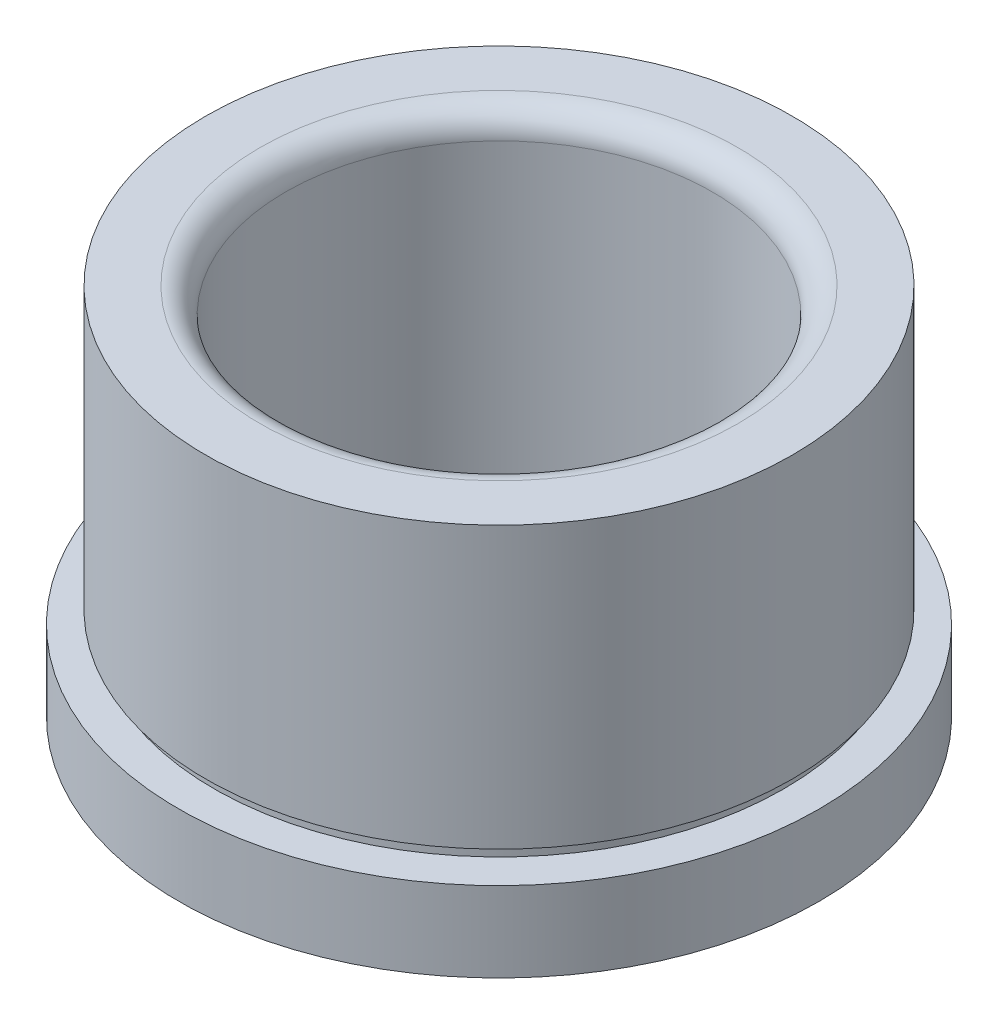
ISO-10303-21;
HEADER;
FILE_DESCRIPTION(('STEP AP214'),'2;1');
FILE_NAME('part.step','',(''),(''),'','','');
FILE_SCHEMA(('AUTOMOTIVE_DESIGN { 1 0 10303 214 1 1 1 1 }'));
ENDSEC;
DATA;
#1=APPLICATION_CONTEXT('core data for automotive mechanical design processes');
#2=APPLICATION_PROTOCOL_DEFINITION('international standard','automotive_design',2000,#1);
#3=PRODUCT_CONTEXT('',#1,'mechanical');
#4=PRODUCT('Part','Part','',(#3));
#5=PRODUCT_RELATED_PRODUCT_CATEGORY('part','',(#4));
#6=PRODUCT_DEFINITION_FORMATION('','',#4);
#7=PRODUCT_DEFINITION_CONTEXT('part definition',#1,'design');
#8=PRODUCT_DEFINITION('design','',#6,#7);
#9=PRODUCT_DEFINITION_SHAPE('','',#8);
#10=(LENGTH_UNIT() NAMED_UNIT(*) SI_UNIT(.MILLI.,.METRE.));
#11=(NAMED_UNIT(*) PLANE_ANGLE_UNIT() SI_UNIT($,.RADIAN.));
#12=(NAMED_UNIT(*) SI_UNIT($,.STERADIAN.) SOLID_ANGLE_UNIT());
#13=UNCERTAINTY_MEASURE_WITH_UNIT(LENGTH_MEASURE(1.E-05),#10,'distance_accuracy_value','');
#14=(GEOMETRIC_REPRESENTATION_CONTEXT(3) GLOBAL_UNCERTAINTY_ASSIGNED_CONTEXT((#13)) GLOBAL_UNIT_ASSIGNED_CONTEXT((#10,
#11,#12)) REPRESENTATION_CONTEXT('',''));
#15=CARTESIAN_POINT('',(0.,0.,0.));
#16=DIRECTION('',(0.,0.,1.));
#17=DIRECTION('',(1.,0.,0.));
#18=AXIS2_PLACEMENT_3D('',#15,#16,#17);
#19=CARTESIAN_POINT('',(-17.46885,38.1506908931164,0.));
#20=DIRECTION('',(0.,-1.,0.));
#21=DIRECTION('',(1.,0.,0.));
#22=AXIS2_PLACEMENT_3D('',#19,#20,#21);
#23=PLANE('',#22);
#24=CARTESIAN_POINT('',(-1.33202502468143E-13,38.1506908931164,0.));
#25=DIRECTION('',(0.,-1.,0.));
#26=DIRECTION('',(1.,0.,0.));
#27=AXIS2_PLACEMENT_3D('',#24,#25,#26);
#28=CIRCLE('',#27,14.2303499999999);
#29=CARTESIAN_POINT('',(14.2303499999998,38.1506908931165,0.));
#30=VERTEX_POINT('',#29);
#31=EDGE_CURVE('E36',#30,#30,#28,.T.);
#32=ORIENTED_EDGE('',*,*,#31,.T.);
#33=EDGE_LOOP('',(#32));
#34=FACE_BOUND('',#33,.T.);
#35=CARTESIAN_POINT('',(-1.33202502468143E-13,38.1506908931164,0.));
#36=DIRECTION('',(0.,-1.,0.));
#37=DIRECTION('',(1.,0.,0.));
#38=AXIS2_PLACEMENT_3D('',#35,#36,#37);
#39=CIRCLE('',#38,17.4688499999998);
#40=CARTESIAN_POINT('',(17.4688499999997,38.1506908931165,0.));
#41=VERTEX_POINT('',#40);
#42=EDGE_CURVE('E40',#41,#41,#39,.T.);
#43=ORIENTED_EDGE('',*,*,#42,.F.);
#44=EDGE_LOOP('',(#43));
#45=FACE_BOUND('',#44,.T.);
#46=ADVANCED_FACE('F29',(#34,#45),#23,.F.);
#47=CARTESIAN_POINT('',(3.49148336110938E-12,-1000.,0.));
#48=DIRECTION('',(0.,-1.,0.));
#49=DIRECTION('',(1.,0.,0.));
#50=AXIS2_PLACEMENT_3D('',#47,#48,#49);
#51=CYLINDRICAL_SURFACE('',#50,17.4688499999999);
#52=CARTESIAN_POINT('',(0.,21.4501908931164,0.));
#53=DIRECTION('',(0.,-1.,0.));
#54=DIRECTION('',(1.,0.,0.));
#55=AXIS2_PLACEMENT_3D('',#52,#53,#54);
#56=CIRCLE('',#55,17.4688499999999);
#57=CARTESIAN_POINT('',(17.4688499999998,21.4501908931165,0.));
#58=VERTEX_POINT('',#57);
#59=EDGE_CURVE('E44',#58,#58,#56,.T.);
#60=ORIENTED_EDGE('',*,*,#59,.F.);
#61=EDGE_LOOP('',(#60));
#62=FACE_BOUND('',#61,.T.);
#63=ORIENTED_EDGE('',*,*,#42,.T.);
#64=EDGE_LOOP('',(#63));
#65=FACE_BOUND('',#64,.T.);
#66=ADVANCED_FACE('F103',(#62,#65),#51,.T.);
#67=CARTESIAN_POINT('',(-17.46885,21.4501908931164,0.));
#68=DIRECTION('',(0.,1.,0.));
#69=DIRECTION('',(-1.,0.,0.));
#70=AXIS2_PLACEMENT_3D('',#67,#68,#69);
#71=PLANE('',#70);
#72=CARTESIAN_POINT('',(0.,21.4501908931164,0.));
#73=DIRECTION('',(0.,-1.,0.));
#74=DIRECTION('',(1.,0.,0.));
#75=AXIS2_PLACEMENT_3D('',#72,#73,#74);
#76=CIRCLE('',#75,16.9608499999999);
#77=CARTESIAN_POINT('',(16.9608499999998,21.4501908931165,0.));
#78=VERTEX_POINT('',#77);
#79=EDGE_CURVE('E49',#78,#78,#76,.T.);
#80=ORIENTED_EDGE('',*,*,#79,.F.);
#81=EDGE_LOOP('',(#80));
#82=FACE_BOUND('',#81,.T.);
#83=ORIENTED_EDGE('',*,*,#59,.T.);
#84=EDGE_LOOP('',(#83));
#85=FACE_BOUND('',#84,.T.);
#86=ADVANCED_FACE('F97',(#82,#85),#71,.F.);
#87=CARTESIAN_POINT('',(3.49148336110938E-12,-1000.,0.));
#88=DIRECTION('',(0.,-1.,0.));
#89=DIRECTION('',(1.,0.,0.));
#90=AXIS2_PLACEMENT_3D('',#87,#88,#89);
#91=CYLINDRICAL_SURFACE('',#90,16.9608499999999);
#92=CARTESIAN_POINT('',(0.,20.6881908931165,0.));
#93=DIRECTION('',(0.,-1.,0.));
#94=DIRECTION('',(1.,0.,0.));
#95=AXIS2_PLACEMENT_3D('',#92,#93,#94);
#96=CIRCLE('',#95,16.9608499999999);
#97=CARTESIAN_POINT('',(16.9608499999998,20.6881908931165,0.));
#98=VERTEX_POINT('',#97);
#99=EDGE_CURVE('E52',#98,#98,#96,.T.);
#100=ORIENTED_EDGE('',*,*,#99,.F.);
#101=EDGE_LOOP('',(#100));
#102=FACE_BOUND('',#101,.T.);
#103=ORIENTED_EDGE('',*,*,#79,.T.);
#104=EDGE_LOOP('',(#103));
#105=FACE_BOUND('',#104,.T.);
#106=ADVANCED_FACE('F91',(#102,#105),#91,.T.);
#107=CARTESIAN_POINT('',(-19.05,20.6881908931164,0.));
#108=DIRECTION('',(0.,-1.,0.));
#109=DIRECTION('',(1.,0.,0.));
#110=AXIS2_PLACEMENT_3D('',#107,#108,#109);
#111=PLANE('',#110);
#112=CARTESIAN_POINT('',(0.,20.6881908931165,0.));
#113=DIRECTION('',(0.,-1.,0.));
#114=DIRECTION('',(1.,0.,0.));
#115=AXIS2_PLACEMENT_3D('',#112,#113,#114);
#116=CIRCLE('',#115,19.0499999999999);
#117=CARTESIAN_POINT('',(19.0499999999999,20.6881908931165,0.));
#118=VERTEX_POINT('',#117);
#119=EDGE_CURVE('E55',#118,#118,#116,.T.);
#120=ORIENTED_EDGE('',*,*,#119,.F.);
#121=EDGE_LOOP('',(#120));
#122=FACE_BOUND('',#121,.T.);
#123=ORIENTED_EDGE('',*,*,#99,.T.);
#124=EDGE_LOOP('',(#123));
#125=FACE_BOUND('',#124,.T.);
#126=ADVANCED_FACE('F85',(#122,#125),#111,.F.);
#127=CARTESIAN_POINT('',(3.49148336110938E-12,-1000.,0.));
#128=DIRECTION('',(0.,-1.,0.));
#129=DIRECTION('',(1.,0.,0.));
#130=AXIS2_PLACEMENT_3D('',#127,#128,#129);
#131=CYLINDRICAL_SURFACE('',#130,19.0499999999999);
#132=CARTESIAN_POINT('',(0.,15.9256908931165,0.));
#133=DIRECTION('',(0.,-1.,0.));
#134=DIRECTION('',(1.,0.,0.));
#135=AXIS2_PLACEMENT_3D('',#132,#133,#134);
#136=CIRCLE('',#135,19.0499999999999);
#137=CARTESIAN_POINT('',(19.0499999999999,15.9256908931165,0.));
#138=VERTEX_POINT('',#137);
#139=EDGE_CURVE('E58',#138,#138,#136,.T.);
#140=ORIENTED_EDGE('',*,*,#139,.F.);
#141=EDGE_LOOP('',(#140));
#142=FACE_BOUND('',#141,.T.);
#143=ORIENTED_EDGE('',*,*,#119,.T.);
#144=EDGE_LOOP('',(#143));
#145=FACE_BOUND('',#144,.T.);
#146=ADVANCED_FACE('F79',(#142,#145),#131,.T.);
#147=CARTESIAN_POINT('',(-13.5224055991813,15.9256908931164,0.));
#148=DIRECTION('',(0.,1.,0.));
#149=DIRECTION('',(-1.,0.,0.));
#150=AXIS2_PLACEMENT_3D('',#147,#148,#149);
#151=PLANE('',#150);
#152=CARTESIAN_POINT('',(0.,15.9256908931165,0.));
#153=DIRECTION('',(0.,-1.,0.));
#154=DIRECTION('',(1.,0.,0.));
#155=AXIS2_PLACEMENT_3D('',#152,#153,#154);
#156=CIRCLE('',#155,13.5224055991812);
#157=CARTESIAN_POINT('',(13.5224055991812,15.9256908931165,0.));
#158=VERTEX_POINT('',#157);
#159=EDGE_CURVE('E61',#158,#158,#156,.T.);
#160=ORIENTED_EDGE('',*,*,#159,.F.);
#161=EDGE_LOOP('',(#160));
#162=FACE_BOUND('',#161,.T.);
#163=ORIENTED_EDGE('',*,*,#139,.T.);
#164=EDGE_LOOP('',(#163));
#165=FACE_BOUND('',#164,.T.);
#166=ADVANCED_FACE('F73',(#162,#165),#151,.F.);
#167=CARTESIAN_POINT('',(0.,15.9256908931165,0.));
#168=DIRECTION('',(0.,-1.,0.));
#169=DIRECTION('',(1.,0.,0.));
#170=AXIS2_PLACEMENT_3D('',#167,#168,#169);
#171=CONICAL_SURFACE('',#170,13.5224055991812,0.785398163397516);
#172=CARTESIAN_POINT('',(0.,16.7417464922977,0.));
#173=DIRECTION('',(0.,-1.,0.));
#174=DIRECTION('',(1.,0.,0.));
#175=AXIS2_PLACEMENT_3D('',#172,#173,#174);
#176=CIRCLE('',#175,12.7063499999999);
#177=CARTESIAN_POINT('',(12.7063499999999,16.7417464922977,0.));
#178=VERTEX_POINT('',#177);
#179=EDGE_CURVE('E64',#178,#178,#176,.T.);
#180=ORIENTED_EDGE('',*,*,#179,.F.);
#181=EDGE_LOOP('',(#180));
#182=FACE_BOUND('',#181,.T.);
#183=ORIENTED_EDGE('',*,*,#159,.T.);
#184=EDGE_LOOP('',(#183));
#185=FACE_BOUND('',#184,.T.);
#186=ADVANCED_FACE('F70',(#182,#185),#171,.F.);
#187=CARTESIAN_POINT('',(3.49148336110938E-12,-1000.,0.));
#188=DIRECTION('',(0.,-1.,0.));
#189=DIRECTION('',(1.,0.,0.));
#190=AXIS2_PLACEMENT_3D('',#187,#188,#189);
#191=CYLINDRICAL_SURFACE('',#190,12.7063499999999);
#192=CARTESIAN_POINT('',(-1.27881481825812E-13,36.6266908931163,0.));
#193=DIRECTION('',(0.,-1.,0.));
#194=DIRECTION('',(1.,0.,0.));
#195=AXIS2_PLACEMENT_3D('',#192,#193,#194);
#196=CIRCLE('',#195,12.7063499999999);
#197=CARTESIAN_POINT('',(12.7063499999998,36.6266908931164,0.));
#198=VERTEX_POINT('',#197);
#199=EDGE_CURVE('E10',#198,#198,#196,.F.);
#200=ORIENTED_EDGE('',*,*,#199,.T.);
#201=EDGE_LOOP('',(#200));
#202=FACE_BOUND('',#201,.T.);
#203=ORIENTED_EDGE('',*,*,#179,.T.);
#204=EDGE_LOOP('',(#203));
#205=FACE_BOUND('',#204,.T.);
#206=ADVANCED_FACE('F68',(#202,#205),#191,.F.);
#207=CARTESIAN_POINT('',(-1.27881481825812E-13,36.6266908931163,0.));
#208=DIRECTION('',(0.,-1.,0.));
#209=DIRECTION('',(1.,0.,0.));
#210=AXIS2_PLACEMENT_3D('',#207,#208,#209);
#211=TOROIDAL_SURFACE('',#210,14.2303499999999,1.524);
#212=ORIENTED_EDGE('',*,*,#199,.F.);
#213=EDGE_LOOP('',(#212));
#214=FACE_BOUND('',#213,.T.);
#215=ORIENTED_EDGE('',*,*,#31,.F.);
#216=EDGE_LOOP('',(#215));
#217=FACE_BOUND('',#216,.T.);
#218=ADVANCED_FACE('F31',(#214,#217),#211,.T.);
#219=CLOSED_SHELL('',(#46,#66,#86,#106,#126,#146,#166,#186,#206,#218));
#220=MANIFOLD_SOLID_BREP('B2',#219);
#221=ADVANCED_BREP_SHAPE_REPRESENTATION('',(#18,#220),#14);
#222=SHAPE_DEFINITION_REPRESENTATION(#9,#221);
ENDSEC;
END-ISO-10303-21;
